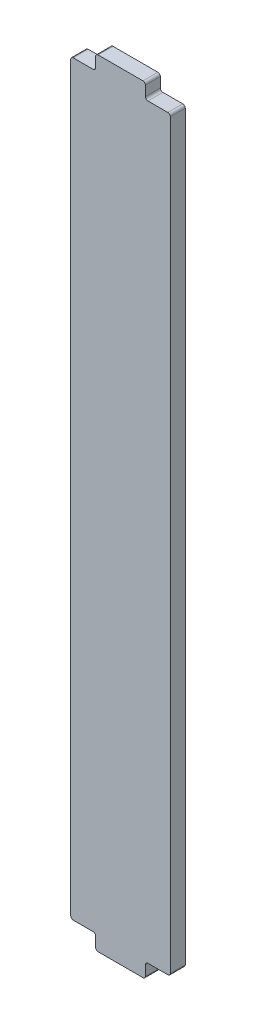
from build123d import *

# Parameters (mm, degrees)
BOSS_EXTRUDE1_DEPTH = 6


with BuildPart() as part:
    # Sketch1 → Boss-Extrude1 (new body)
    with BuildSketch(Plane.XY):
        with BuildLine():
            Line((-9, 0), (9, 0))
            ThreePointArc((9, 0), (9.707106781, 0.292893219), (10, 1))
            Line((10, 1), (10, 5))
            ThreePointArc((10, 5), (10.292893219, 5.707106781), (11, 6))
            Line((11, 6), (19, 6))
            ThreePointArc((19, 6), (19.707106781, 6.292893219), (20, 7))
            Line((20, 7), (20, 305))
            ThreePointArc((20, 305), (19.707106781, 305.707106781), (19, 306))
            Line((19, 306), (11, 306))
            ThreePointArc((11, 306), (10.292893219, 306.292893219), (10, 307))
            Line((10, 307), (10, 311))
            ThreePointArc((10, 311), (9.707106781, 311.707106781), (9, 312))
            Line((9, 312), (-9, 312))
            ThreePointArc((-9, 312), (-9.707106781, 311.707106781), (-10, 311))
            Line((-10, 311), (-10, 307))
            ThreePointArc((-10, 307), (-10.292893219, 306.292893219), (-11, 306))
            Line((-11, 306), (-19, 306))
            ThreePointArc((-19, 306), (-19.707106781, 305.707106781), (-20, 305))
            Line((-20, 305), (-20, 7))
            ThreePointArc((-20, 7), (-19.707106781, 6.292893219), (-19, 6))
            Line((-19, 6), (-11, 6))
            ThreePointArc((-11, 6), (-10.292893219, 5.707106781), (-10, 5))
            Line((-10, 5), (-10, 1))
            ThreePointArc((-10, 1), (-9.707106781, 0.292893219), (-9, 0))
        make_face()
    extrude(amount=BOSS_EXTRUDE1_DEPTH)


solid = part.part
